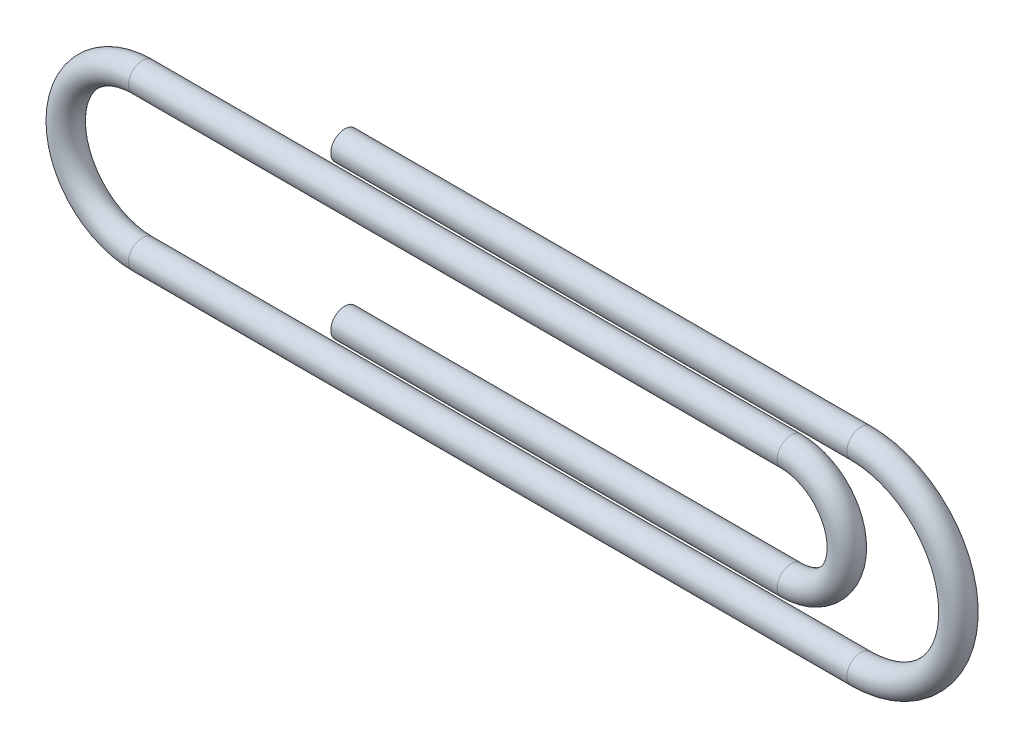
ISO-10303-21;
HEADER;
FILE_DESCRIPTION(('STEP AP214'),'2;1');
FILE_NAME('part.step','',(''),(''),'','','');
FILE_SCHEMA(('AUTOMOTIVE_DESIGN { 1 0 10303 214 1 1 1 1 }'));
ENDSEC;
DATA;
#1=APPLICATION_CONTEXT('core data for automotive mechanical design processes');
#2=APPLICATION_PROTOCOL_DEFINITION('international standard','automotive_design',2000,#1);
#3=PRODUCT_CONTEXT('',#1,'mechanical');
#4=PRODUCT('Part','Part','',(#3));
#5=PRODUCT_RELATED_PRODUCT_CATEGORY('part','',(#4));
#6=PRODUCT_DEFINITION_FORMATION('','',#4);
#7=PRODUCT_DEFINITION_CONTEXT('part definition',#1,'design');
#8=PRODUCT_DEFINITION('design','',#6,#7);
#9=PRODUCT_DEFINITION_SHAPE('','',#8);
#10=(LENGTH_UNIT() NAMED_UNIT(*) SI_UNIT(.MILLI.,.METRE.));
#11=(NAMED_UNIT(*) PLANE_ANGLE_UNIT() SI_UNIT($,.RADIAN.));
#12=(NAMED_UNIT(*) SI_UNIT($,.STERADIAN.) SOLID_ANGLE_UNIT());
#13=UNCERTAINTY_MEASURE_WITH_UNIT(LENGTH_MEASURE(1.E-05),#10,'distance_accuracy_value','');
#14=(GEOMETRIC_REPRESENTATION_CONTEXT(3) GLOBAL_UNCERTAINTY_ASSIGNED_CONTEXT((#13)) GLOBAL_UNIT_ASSIGNED_CONTEXT((#10,
#11,#12)) REPRESENTATION_CONTEXT('',''));
#15=CARTESIAN_POINT('',(0.,0.,0.));
#16=DIRECTION('',(0.,0.,1.));
#17=DIRECTION('',(1.,0.,0.));
#18=AXIS2_PLACEMENT_3D('',#15,#16,#17);
#19=CARTESIAN_POINT('',(18.5,5.5,0.));
#20=DIRECTION('',(-1.,0.,0.));
#21=DIRECTION('',(0.,-1.,0.));
#22=AXIS2_PLACEMENT_3D('',#19,#20,#21);
#23=CYLINDRICAL_SURFACE('',#22,0.5);
#24=CARTESIAN_POINT('',(18.5,5.5,0.));
#25=DIRECTION('',(-1.,0.,0.));
#26=DIRECTION('',(0.,0.,-1.));
#27=AXIS2_PLACEMENT_3D('',#24,#25,#26);
#28=CIRCLE('',#27,0.5);
#29=CARTESIAN_POINT('',(18.5,6.,0.));
#30=VERTEX_POINT('',#29);
#31=EDGE_CURVE('E32',#30,#30,#28,.T.);
#32=ORIENTED_EDGE('',*,*,#31,.T.);
#33=EDGE_LOOP('',(#32));
#34=FACE_BOUND('',#33,.T.);
#35=CARTESIAN_POINT('',(0.,5.49999999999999,0.));
#36=DIRECTION('',(-1.,0.,0.));
#37=DIRECTION('',(0.,0.,-1.));
#38=AXIS2_PLACEMENT_3D('',#35,#36,#37);
#39=CIRCLE('',#38,0.5);
#40=CARTESIAN_POINT('',(0.,5.49999999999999,-0.5));
#41=VERTEX_POINT('',#40);
#42=EDGE_CURVE('E10',#41,#41,#39,.T.);
#43=ORIENTED_EDGE('',*,*,#42,.F.);
#44=EDGE_LOOP('',(#43));
#45=FACE_BOUND('',#44,.T.);
#46=ADVANCED_FACE('F26',(#34,#45),#23,.T.);
#47=CARTESIAN_POINT('',(18.5,2.,0.));
#48=DIRECTION('',(0.,0.,1.));
#49=DIRECTION('',(1.,0.,0.));
#50=AXIS2_PLACEMENT_3D('',#47,#48,#49);
#51=TOROIDAL_SURFACE('',#50,3.5,0.5);
#52=CARTESIAN_POINT('',(18.5,-1.5,0.));
#53=DIRECTION('',(1.,0.,0.));
#54=DIRECTION('',(0.,0.,-1.));
#55=AXIS2_PLACEMENT_3D('',#52,#53,#54);
#56=CIRCLE('',#55,0.5);
#57=CARTESIAN_POINT('',(18.5,-2.,0.));
#58=VERTEX_POINT('',#57);
#59=EDGE_CURVE('E36',#58,#58,#56,.T.);
#60=CARTESIAN_POINT('',(18.5,2.,0.));
#61=DIRECTION('',(0.,0.,1.));
#62=DIRECTION('',(1.,0.,0.));
#63=AXIS2_PLACEMENT_3D('',#60,#61,#62);
#64=CIRCLE('',#63,4.);
#65=EDGE_CURVE('',#58,#30,#64,.T.);
#66=ORIENTED_EDGE('',*,*,#59,.T.);
#67=ORIENTED_EDGE('',*,*,#31,.F.);
#68=ORIENTED_EDGE('',*,*,#65,.T.);
#69=ORIENTED_EDGE('',*,*,#65,.F.);
#70=EDGE_LOOP('',(#66,#68,#67,#69));
#71=FACE_BOUND('',#70,.T.);
#72=ADVANCED_FACE('F69',(#71),#51,.T.);
#73=CARTESIAN_POINT('',(-7.25,-1.5,0.));
#74=DIRECTION('',(1.,0.,0.));
#75=DIRECTION('',(0.,1.,0.));
#76=AXIS2_PLACEMENT_3D('',#73,#74,#75);
#77=CYLINDRICAL_SURFACE('',#76,0.5);
#78=CARTESIAN_POINT('',(-7.25,-1.5,0.));
#79=DIRECTION('',(1.,0.,0.));
#80=DIRECTION('',(0.,0.,-1.));
#81=AXIS2_PLACEMENT_3D('',#78,#79,#80);
#82=CIRCLE('',#81,0.5);
#83=CARTESIAN_POINT('',(-7.25,-2.,0.));
#84=VERTEX_POINT('',#83);
#85=EDGE_CURVE('E40',#84,#84,#82,.T.);
#86=ORIENTED_EDGE('',*,*,#85,.T.);
#87=EDGE_LOOP('',(#86));
#88=FACE_BOUND('',#87,.T.);
#89=ORIENTED_EDGE('',*,*,#59,.F.);
#90=EDGE_LOOP('',(#89));
#91=FACE_BOUND('',#90,.T.);
#92=ADVANCED_FACE('F73',(#88,#91),#77,.T.);
#93=CARTESIAN_POINT('',(-7.25,1.24999999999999,0.));
#94=DIRECTION('',(0.,0.,1.));
#95=DIRECTION('',(1.,0.,0.));
#96=AXIS2_PLACEMENT_3D('',#93,#94,#95);
#97=TOROIDAL_SURFACE('',#96,2.74999999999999,0.5);
#98=CARTESIAN_POINT('',(-7.25,3.99999999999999,0.));
#99=DIRECTION('',(-1.,0.,0.));
#100=DIRECTION('',(0.,0.,-1.));
#101=AXIS2_PLACEMENT_3D('',#98,#99,#100);
#102=CIRCLE('',#101,0.5);
#103=CARTESIAN_POINT('',(-7.25,4.49999999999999,0.));
#104=VERTEX_POINT('',#103);
#105=EDGE_CURVE('E45',#104,#104,#102,.T.);
#106=CARTESIAN_POINT('',(-7.25,1.24999999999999,0.));
#107=DIRECTION('',(0.,0.,1.));
#108=DIRECTION('',(1.,0.,0.));
#109=AXIS2_PLACEMENT_3D('',#106,#107,#108);
#110=CIRCLE('',#109,3.24999999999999);
#111=EDGE_CURVE('',#104,#84,#110,.T.);
#112=ORIENTED_EDGE('',*,*,#105,.T.);
#113=ORIENTED_EDGE('',*,*,#85,.F.);
#114=ORIENTED_EDGE('',*,*,#111,.T.);
#115=ORIENTED_EDGE('',*,*,#111,.F.);
#116=EDGE_LOOP('',(#112,#114,#113,#115));
#117=FACE_BOUND('',#116,.T.);
#118=ADVANCED_FACE('F79',(#117),#97,.T.);
#119=CARTESIAN_POINT('',(16.,4.,0.));
#120=DIRECTION('',(-1.,0.,0.));
#121=DIRECTION('',(0.,-1.,0.));
#122=AXIS2_PLACEMENT_3D('',#119,#120,#121);
#123=CYLINDRICAL_SURFACE('',#122,0.5);
#124=CARTESIAN_POINT('',(16.,4.,0.));
#125=DIRECTION('',(-1.,0.,0.));
#126=DIRECTION('',(0.,0.,-1.));
#127=AXIS2_PLACEMENT_3D('',#124,#125,#126);
#128=CIRCLE('',#127,0.5);
#129=CARTESIAN_POINT('',(16.,4.5,0.));
#130=VERTEX_POINT('',#129);
#131=EDGE_CURVE('E48',#130,#130,#128,.T.);
#132=ORIENTED_EDGE('',*,*,#131,.T.);
#133=EDGE_LOOP('',(#132));
#134=FACE_BOUND('',#133,.T.);
#135=ORIENTED_EDGE('',*,*,#105,.F.);
#136=EDGE_LOOP('',(#135));
#137=FACE_BOUND('',#136,.T.);
#138=ADVANCED_FACE('F86',(#134,#137),#123,.T.);
#139=CARTESIAN_POINT('',(16.,2.,0.));
#140=DIRECTION('',(0.,0.,1.));
#141=DIRECTION('',(1.,0.,0.));
#142=AXIS2_PLACEMENT_3D('',#139,#140,#141);
#143=TOROIDAL_SURFACE('',#142,2.,0.5);
#144=CARTESIAN_POINT('',(16.,0.,0.));
#145=DIRECTION('',(1.,0.,0.));
#146=DIRECTION('',(0.,0.,-1.));
#147=AXIS2_PLACEMENT_3D('',#144,#145,#146);
#148=CIRCLE('',#147,0.5);
#149=CARTESIAN_POINT('',(16.,-0.5,0.));
#150=VERTEX_POINT('',#149);
#151=EDGE_CURVE('E51',#150,#150,#148,.T.);
#152=CARTESIAN_POINT('',(16.,2.,0.));
#153=DIRECTION('',(0.,0.,1.));
#154=DIRECTION('',(1.,0.,0.));
#155=AXIS2_PLACEMENT_3D('',#152,#153,#154);
#156=CIRCLE('',#155,2.5);
#157=EDGE_CURVE('',#150,#130,#156,.T.);
#158=ORIENTED_EDGE('',*,*,#151,.T.);
#159=ORIENTED_EDGE('',*,*,#131,.F.);
#160=ORIENTED_EDGE('',*,*,#157,.T.);
#161=ORIENTED_EDGE('',*,*,#157,.F.);
#162=EDGE_LOOP('',(#158,#160,#159,#161));
#163=FACE_BOUND('',#162,.T.);
#164=ADVANCED_FACE('F90',(#163),#143,.T.);
#165=CARTESIAN_POINT('',(16.,0.,0.));
#166=DIRECTION('',(-1.,0.,0.));
#167=DIRECTION('',(0.,0.,1.));
#168=AXIS2_PLACEMENT_3D('',#165,#166,#167);
#169=CYLINDRICAL_SURFACE('',#168,0.5);
#170=ORIENTED_EDGE('',*,*,#151,.F.);
#171=EDGE_LOOP('',(#170));
#172=FACE_BOUND('',#171,.T.);
#173=CARTESIAN_POINT('',(0.,0.,0.));
#174=DIRECTION('',(1.,0.,0.));
#175=DIRECTION('',(0.,0.,-1.));
#176=AXIS2_PLACEMENT_3D('',#173,#174,#175);
#177=CIRCLE('',#176,0.5);
#178=CARTESIAN_POINT('',(0.,0.,-0.5));
#179=VERTEX_POINT('',#178);
#180=EDGE_CURVE('E54',#179,#179,#177,.T.);
#181=ORIENTED_EDGE('',*,*,#180,.T.);
#182=EDGE_LOOP('',(#181));
#183=FACE_BOUND('',#182,.T.);
#184=ADVANCED_FACE('F58',(#172,#183),#169,.T.);
#185=CARTESIAN_POINT('',(0.,5.49999999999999,0.));
#186=DIRECTION('',(-1.,0.,0.));
#187=DIRECTION('',(0.,0.,-1.));
#188=AXIS2_PLACEMENT_3D('',#185,#186,#187);
#189=PLANE('',#188);
#190=ORIENTED_EDGE('',*,*,#42,.T.);
#191=EDGE_LOOP('',(#190));
#192=FACE_BOUND('',#191,.T.);
#193=ADVANCED_FACE('F62',(#192),#189,.T.);
#194=CARTESIAN_POINT('',(0.,0.,0.));
#195=DIRECTION('',(1.,0.,0.));
#196=DIRECTION('',(0.,0.,-1.));
#197=AXIS2_PLACEMENT_3D('',#194,#195,#196);
#198=PLANE('',#197);
#199=ORIENTED_EDGE('',*,*,#180,.F.);
#200=EDGE_LOOP('',(#199));
#201=FACE_BOUND('',#200,.T.);
#202=ADVANCED_FACE('F60',(#201),#198,.F.);
#203=CLOSED_SHELL('',(#46,#72,#92,#118,#138,#164,#184,#193,#202));
#204=MANIFOLD_SOLID_BREP('B2',#203);
#205=ADVANCED_BREP_SHAPE_REPRESENTATION('',(#18,#204),#14);
#206=SHAPE_DEFINITION_REPRESENTATION(#9,#205);
ENDSEC;
END-ISO-10303-21;
